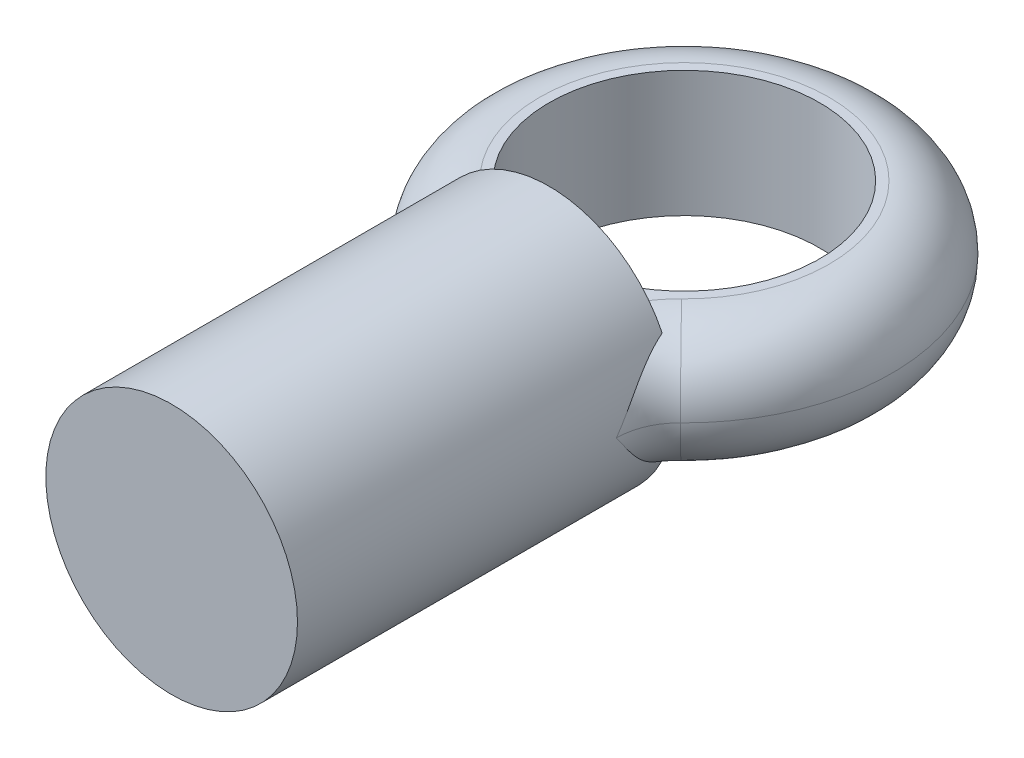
ISO-10303-21;
HEADER;
FILE_DESCRIPTION(('STEP AP214'),'2;1');
FILE_NAME('part.step','',(''),(''),'','','');
FILE_SCHEMA(('AUTOMOTIVE_DESIGN { 1 0 10303 214 1 1 1 1 }'));
ENDSEC;
DATA;
#1=APPLICATION_CONTEXT('core data for automotive mechanical design processes');
#2=APPLICATION_PROTOCOL_DEFINITION('international standard','automotive_design',2000,#1);
#3=PRODUCT_CONTEXT('',#1,'mechanical');
#4=PRODUCT('Part','Part','',(#3));
#5=PRODUCT_RELATED_PRODUCT_CATEGORY('part','',(#4));
#6=PRODUCT_DEFINITION_FORMATION('','',#4);
#7=PRODUCT_DEFINITION_CONTEXT('part definition',#1,'design');
#8=PRODUCT_DEFINITION('design','',#6,#7);
#9=PRODUCT_DEFINITION_SHAPE('','',#8);
#10=(LENGTH_UNIT() NAMED_UNIT(*) SI_UNIT(.MILLI.,.METRE.));
#11=(NAMED_UNIT(*) PLANE_ANGLE_UNIT() SI_UNIT($,.RADIAN.));
#12=(NAMED_UNIT(*) SI_UNIT($,.STERADIAN.) SOLID_ANGLE_UNIT());
#13=UNCERTAINTY_MEASURE_WITH_UNIT(LENGTH_MEASURE(1.E-05),#10,'distance_accuracy_value','');
#14=(GEOMETRIC_REPRESENTATION_CONTEXT(3) GLOBAL_UNCERTAINTY_ASSIGNED_CONTEXT((#13)) GLOBAL_UNIT_ASSIGNED_CONTEXT((#10,
#11,#12)) REPRESENTATION_CONTEXT('',''));
#15=CARTESIAN_POINT('',(0.,0.,0.));
#16=DIRECTION('',(0.,0.,1.));
#17=DIRECTION('',(1.,0.,0.));
#18=AXIS2_PLACEMENT_3D('',#15,#16,#17);
#19=CARTESIAN_POINT('',(0.,0.,30.));
#20=DIRECTION('',(0.,0.,-1.));
#21=DIRECTION('',(-1.,0.,0.));
#22=AXIS2_PLACEMENT_3D('',#19,#20,#21);
#23=CYLINDRICAL_SURFACE('',#22,10.);
#24=CARTESIAN_POINT('',(0.,0.,30.));
#25=DIRECTION('',(0.,0.,1.));
#26=DIRECTION('',(1.,0.,0.));
#27=AXIS2_PLACEMENT_3D('',#24,#25,#26);
#28=CIRCLE('',#27,10.);
#29=CARTESIAN_POINT('',(10.,0.,30.));
#30=VERTEX_POINT('',#29);
#31=EDGE_CURVE('E132',#30,#30,#28,.T.);
#32=ORIENTED_EDGE('',*,*,#31,.F.);
#33=EDGE_LOOP('',(#32));
#34=FACE_BOUND('',#33,.T.);
#35=CARTESIAN_POINT('',(-8.98554489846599,4.38861970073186,0.));
#36=CARTESIAN_POINT('',(-9.00545849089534,4.3478451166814,0.0963270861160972));
#37=CARTESIAN_POINT('',(-9.02599673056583,4.30509203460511,0.191670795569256));
#38=CARTESIAN_POINT('',(-9.06808681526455,4.21571430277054,0.38028497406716));
#39=CARTESIAN_POINT('',(-9.0896385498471,4.16909007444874,0.473555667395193));
#40=CARTESIAN_POINT('',(-9.15541795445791,4.0236338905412,0.749922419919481));
#41=CARTESIAN_POINT('',(-9.20081563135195,3.91912642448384,0.929790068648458));
#42=CARTESIAN_POINT('',(-9.29233488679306,3.69686890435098,1.27888184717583));
#43=CARTESIAN_POINT('',(-9.3384483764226,3.57922516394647,1.4481762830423));
#44=CARTESIAN_POINT('',(-9.42974629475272,3.33126460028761,1.7774941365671));
#45=CARTESIAN_POINT('',(-9.4749306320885,3.20094653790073,1.9375166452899));
#46=CARTESIAN_POINT('',(-9.55293566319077,2.95870133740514,2.21467672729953));
#47=CARTESIAN_POINT('',(-9.58630725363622,2.84894267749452,2.33356916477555));
#48=CARTESIAN_POINT('',(-9.65048757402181,2.62332602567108,2.56614670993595));
#49=CARTESIAN_POINT('',(-9.68129623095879,2.50746786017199,2.67983166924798));
#50=CARTESIAN_POINT('',(-9.73961800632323,2.27040721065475,2.90248156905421));
#51=CARTESIAN_POINT('',(-9.76712946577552,2.14920207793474,3.01144411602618));
#52=CARTESIAN_POINT('',(-9.8181959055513,1.90234455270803,3.22515559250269));
#53=CARTESIAN_POINT('',(-9.84175103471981,1.77669232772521,3.32990468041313));
#54=CARTESIAN_POINT('',(-9.88491077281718,1.51858072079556,3.53846634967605));
#55=CARTESIAN_POINT('',(-9.90440087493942,1.38602959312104,3.64218881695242));
#56=CARTESIAN_POINT('',(-9.93820973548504,1.11812778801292,3.84671303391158));
#57=CARTESIAN_POINT('',(-9.95253030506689,0.98277810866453,3.94751579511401));
#58=CARTESIAN_POINT('',(-9.97575331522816,0.709413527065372,4.14769259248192));
#59=CARTESIAN_POINT('',(-9.98462528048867,0.57138800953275,4.24705561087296));
#60=CARTESIAN_POINT('',(-9.99662819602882,0.294354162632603,4.44474645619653));
#61=CARTESIAN_POINT('',(-9.9997594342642,0.155345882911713,4.54307433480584));
#62=CARTESIAN_POINT('',(-9.99999556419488,0.0108866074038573,4.64522380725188));
#63=CARTESIAN_POINT('',(-10.0000000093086,0.0054432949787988,4.64907281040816));
#64=CARTESIAN_POINT('',(-10.,0.,4.65292180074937));
#65=B_SPLINE_CURVE_WITH_KNOTS('',3,(#35,#36,#37,#38,#39,#40,#41,#42,#43,#44,#45,#46,#47,#48,#49,
#50,#51,#52,#53,#54,#55,#56,#57,#58,#59,#60,#61,#62,#63,#64),.UNSPECIFIED.,.F.,.F.,(4,2,2,2,2,2,
2,2,2,2,2,2,2,2,4),(0.,0.319387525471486,0.638740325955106,1.27672811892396,1.90988296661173,
2.54309977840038,3.03853167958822,3.53397768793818,4.02967194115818,4.52534754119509,
5.03351370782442,5.54150166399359,6.0523056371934,6.56308398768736,6.58308399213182),.UNSPECIFIED.);
#66=CARTESIAN_POINT('',(-8.98554489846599,4.38861970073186,0.));
#67=VERTEX_POINT('',#66);
#68=CARTESIAN_POINT('',(-10.,0.,4.65292180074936));
#69=VERTEX_POINT('',#68);
#70=EDGE_CURVE('E128',#67,#69,#65,.T.);
#71=ORIENTED_EDGE('',*,*,#70,.T.);
#72=CARTESIAN_POINT('',(-8.98554489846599,-4.38861970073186,0.));
#73=CARTESIAN_POINT('',(-9.00545849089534,-4.3478451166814,0.0963270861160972));
#74=CARTESIAN_POINT('',(-9.02599673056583,-4.30509203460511,0.191670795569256));
#75=CARTESIAN_POINT('',(-9.06808681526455,-4.21571430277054,0.38028497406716));
#76=CARTESIAN_POINT('',(-9.0896385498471,-4.16909007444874,0.473555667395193));
#77=CARTESIAN_POINT('',(-9.15541795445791,-4.0236338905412,0.749922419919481));
#78=CARTESIAN_POINT('',(-9.20081563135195,-3.91912642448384,0.929790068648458));
#79=CARTESIAN_POINT('',(-9.29233488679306,-3.69686890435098,1.27888184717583));
#80=CARTESIAN_POINT('',(-9.3384483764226,-3.57922516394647,1.4481762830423));
#81=CARTESIAN_POINT('',(-9.42974629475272,-3.33126460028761,1.7774941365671));
#82=CARTESIAN_POINT('',(-9.4749306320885,-3.20094653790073,1.9375166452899));
#83=CARTESIAN_POINT('',(-9.55293566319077,-2.95870133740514,2.21467672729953));
#84=CARTESIAN_POINT('',(-9.58630725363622,-2.84894267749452,2.33356916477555));
#85=CARTESIAN_POINT('',(-9.65048757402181,-2.62332602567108,2.56614670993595));
#86=CARTESIAN_POINT('',(-9.68129623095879,-2.50746786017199,2.67983166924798));
#87=CARTESIAN_POINT('',(-9.73961800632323,-2.27040721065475,2.90248156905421));
#88=CARTESIAN_POINT('',(-9.76712946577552,-2.14920207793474,3.01144411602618));
#89=CARTESIAN_POINT('',(-9.8181959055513,-1.90234455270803,3.22515559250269));
#90=CARTESIAN_POINT('',(-9.84175103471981,-1.77669232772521,3.32990468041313));
#91=CARTESIAN_POINT('',(-9.88491077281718,-1.51858072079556,3.53846634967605));
#92=CARTESIAN_POINT('',(-9.90440087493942,-1.38602959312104,3.64218881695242));
#93=CARTESIAN_POINT('',(-9.93820973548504,-1.11812778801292,3.84671303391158));
#94=CARTESIAN_POINT('',(-9.95253030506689,-0.98277810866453,3.94751579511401));
#95=CARTESIAN_POINT('',(-9.97575331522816,-0.709413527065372,4.14769259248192));
#96=CARTESIAN_POINT('',(-9.98462528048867,-0.57138800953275,4.24705561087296));
#97=CARTESIAN_POINT('',(-9.99662819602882,-0.294354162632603,4.44474645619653));
#98=CARTESIAN_POINT('',(-9.9997594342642,-0.155345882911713,4.54307433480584));
#99=CARTESIAN_POINT('',(-9.99999556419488,-0.0108866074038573,4.64522380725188));
#100=CARTESIAN_POINT('',(-10.0000000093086,-0.0054432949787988,4.64907281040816));
#101=CARTESIAN_POINT('',(-10.,0.,4.65292180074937));
#102=B_SPLINE_CURVE_WITH_KNOTS('',3,(#72,#73,#74,#75,#76,#77,#78,#79,#80,#81,#82,#83,#84,#85,
#86,#87,#88,#89,#90,#91,#92,#93,#94,#95,#96,#97,#98,#99,#100,#101),.UNSPECIFIED.,.F.,.F.,(4,2,2,
2,2,2,2,2,2,2,2,2,2,2,4),(0.,0.319387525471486,0.638740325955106,1.27672811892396,
1.90988296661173,2.54309977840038,3.03853167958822,3.53397768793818,4.02967194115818,
4.52534754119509,5.03351370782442,5.54150166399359,6.0523056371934,6.56308398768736,
6.58308399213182),.UNSPECIFIED.);
#103=CARTESIAN_POINT('',(-8.98554489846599,-4.38861970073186,0.));
#104=VERTEX_POINT('',#103);
#105=EDGE_CURVE('E52',#69,#104,#102,.F.);
#106=ORIENTED_EDGE('',*,*,#105,.T.);
#107=CARTESIAN_POINT('',(0.,0.,0.));
#108=DIRECTION('',(0.,0.,1.));
#109=DIRECTION('',(1.,0.,0.));
#110=AXIS2_PLACEMENT_3D('',#107,#108,#109);
#111=CIRCLE('',#110,10.);
#112=CARTESIAN_POINT('',(8.98554489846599,-4.38861970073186,0.));
#113=VERTEX_POINT('',#112);
#114=EDGE_CURVE('E60',#104,#113,#111,.T.);
#115=ORIENTED_EDGE('',*,*,#114,.T.);
#116=CARTESIAN_POINT('',(8.98554489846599,-4.38861970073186,0.));
#117=CARTESIAN_POINT('',(9.00545849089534,-4.3478451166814,0.0963270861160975));
#118=CARTESIAN_POINT('',(9.02599673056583,-4.30509203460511,0.191670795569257));
#119=CARTESIAN_POINT('',(9.06808681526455,-4.21571430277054,0.38028497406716));
#120=CARTESIAN_POINT('',(9.0896385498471,-4.16909007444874,0.473555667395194));
#121=CARTESIAN_POINT('',(9.15541795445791,-4.0236338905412,0.749922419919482));
#122=CARTESIAN_POINT('',(9.20081563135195,-3.91912642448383,0.929790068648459));
#123=CARTESIAN_POINT('',(9.29233488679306,-3.69686890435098,1.27888184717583));
#124=CARTESIAN_POINT('',(9.3384483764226,-3.57922516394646,1.4481762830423));
#125=CARTESIAN_POINT('',(9.42974629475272,-3.33126460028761,1.7774941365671));
#126=CARTESIAN_POINT('',(9.4749306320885,-3.20094653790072,1.9375166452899));
#127=CARTESIAN_POINT('',(9.55293566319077,-2.95870133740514,2.21467672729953));
#128=CARTESIAN_POINT('',(9.58630725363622,-2.84894267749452,2.33356916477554));
#129=CARTESIAN_POINT('',(9.65048757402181,-2.62332602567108,2.56614670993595));
#130=CARTESIAN_POINT('',(9.68129623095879,-2.50746786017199,2.67983166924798));
#131=CARTESIAN_POINT('',(9.73961800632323,-2.27040721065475,2.90248156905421));
#132=CARTESIAN_POINT('',(9.76712946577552,-2.14920207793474,3.01144411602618));
#133=CARTESIAN_POINT('',(9.8181959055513,-1.90234455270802,3.22515559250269));
#134=CARTESIAN_POINT('',(9.84175103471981,-1.77669232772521,3.32990468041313));
#135=CARTESIAN_POINT('',(9.88491077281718,-1.51858072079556,3.53846634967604));
#136=CARTESIAN_POINT('',(9.90440087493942,-1.38602959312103,3.64218881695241));
#137=CARTESIAN_POINT('',(9.93820973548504,-1.11812778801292,3.84671303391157));
#138=CARTESIAN_POINT('',(9.95253030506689,-0.982778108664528,3.94751579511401));
#139=CARTESIAN_POINT('',(9.97575331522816,-0.709413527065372,4.14769259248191));
#140=CARTESIAN_POINT('',(9.98462528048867,-0.57138800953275,4.24705561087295));
#141=CARTESIAN_POINT('',(9.99662819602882,-0.294354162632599,4.44474645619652));
#142=CARTESIAN_POINT('',(9.9997594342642,-0.155345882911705,4.54307433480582));
#143=CARTESIAN_POINT('',(9.99999556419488,-0.0108866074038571,4.64522380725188));
#144=CARTESIAN_POINT('',(10.0000000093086,-0.00544329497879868,4.64907281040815));
#145=CARTESIAN_POINT('',(10.,0.,4.65292180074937));
#146=B_SPLINE_CURVE_WITH_KNOTS('',3,(#116,#117,#118,#119,#120,#121,#122,#123,#124,#125,#126,
#127,#128,#129,#130,#131,#132,#133,#134,#135,#136,#137,#138,#139,#140,#141,#142,#143,#144,#145),
.UNSPECIFIED.,.F.,.F.,(4,2,2,2,2,2,2,2,2,2,2,2,2,2,4),(0.,0.319387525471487,0.638740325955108,
1.27672811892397,1.90988296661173,2.54309977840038,3.03853167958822,3.53397768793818,
4.02967194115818,4.52534754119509,5.03351370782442,5.54150166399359,6.05230563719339,
6.56308398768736,6.58308399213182),.UNSPECIFIED.);
#147=CARTESIAN_POINT('',(10.,0.,4.65292180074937));
#148=VERTEX_POINT('',#147);
#149=EDGE_CURVE('E146',#113,#148,#146,.T.);
#150=ORIENTED_EDGE('',*,*,#149,.T.);
#151=CARTESIAN_POINT('',(8.98554489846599,4.38861970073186,0.));
#152=CARTESIAN_POINT('',(9.00545849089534,4.3478451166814,0.0963270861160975));
#153=CARTESIAN_POINT('',(9.02599673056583,4.30509203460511,0.191670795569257));
#154=CARTESIAN_POINT('',(9.06808681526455,4.21571430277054,0.38028497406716));
#155=CARTESIAN_POINT('',(9.0896385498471,4.16909007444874,0.473555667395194));
#156=CARTESIAN_POINT('',(9.15541795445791,4.0236338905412,0.749922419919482));
#157=CARTESIAN_POINT('',(9.20081563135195,3.91912642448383,0.929790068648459));
#158=CARTESIAN_POINT('',(9.29233488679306,3.69686890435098,1.27888184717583));
#159=CARTESIAN_POINT('',(9.3384483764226,3.57922516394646,1.4481762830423));
#160=CARTESIAN_POINT('',(9.42974629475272,3.33126460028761,1.7774941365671));
#161=CARTESIAN_POINT('',(9.4749306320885,3.20094653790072,1.9375166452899));
#162=CARTESIAN_POINT('',(9.55293566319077,2.95870133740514,2.21467672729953));
#163=CARTESIAN_POINT('',(9.58630725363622,2.84894267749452,2.33356916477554));
#164=CARTESIAN_POINT('',(9.65048757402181,2.62332602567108,2.56614670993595));
#165=CARTESIAN_POINT('',(9.68129623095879,2.50746786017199,2.67983166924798));
#166=CARTESIAN_POINT('',(9.73961800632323,2.27040721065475,2.90248156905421));
#167=CARTESIAN_POINT('',(9.76712946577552,2.14920207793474,3.01144411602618));
#168=CARTESIAN_POINT('',(9.8181959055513,1.90234455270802,3.22515559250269));
#169=CARTESIAN_POINT('',(9.84175103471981,1.77669232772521,3.32990468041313));
#170=CARTESIAN_POINT('',(9.88491077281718,1.51858072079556,3.53846634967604));
#171=CARTESIAN_POINT('',(9.90440087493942,1.38602959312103,3.64218881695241));
#172=CARTESIAN_POINT('',(9.93820973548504,1.11812778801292,3.84671303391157));
#173=CARTESIAN_POINT('',(9.95253030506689,0.982778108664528,3.94751579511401));
#174=CARTESIAN_POINT('',(9.97575331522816,0.709413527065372,4.14769259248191));
#175=CARTESIAN_POINT('',(9.98462528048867,0.57138800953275,4.24705561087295));
#176=CARTESIAN_POINT('',(9.99662819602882,0.294354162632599,4.44474645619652));
#177=CARTESIAN_POINT('',(9.9997594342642,0.155345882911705,4.54307433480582));
#178=CARTESIAN_POINT('',(9.99999556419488,0.0108866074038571,4.64522380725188));
#179=CARTESIAN_POINT('',(10.0000000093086,0.00544329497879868,4.64907281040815));
#180=CARTESIAN_POINT('',(10.,0.,4.65292180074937));
#181=B_SPLINE_CURVE_WITH_KNOTS('',3,(#151,#152,#153,#154,#155,#156,#157,#158,#159,#160,#161,
#162,#163,#164,#165,#166,#167,#168,#169,#170,#171,#172,#173,#174,#175,#176,#177,#178,#179,#180),
.UNSPECIFIED.,.F.,.F.,(4,2,2,2,2,2,2,2,2,2,2,2,2,2,4),(0.,0.319387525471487,0.638740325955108,
1.27672811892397,1.90988296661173,2.54309977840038,3.03853167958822,3.53397768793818,
4.02967194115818,4.52534754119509,5.03351370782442,5.54150166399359,6.05230563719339,
6.56308398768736,6.58308399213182),.UNSPECIFIED.);
#182=CARTESIAN_POINT('',(8.98554489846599,4.38861970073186,0.));
#183=VERTEX_POINT('',#182);
#184=EDGE_CURVE('E130',#148,#183,#181,.F.);
#185=ORIENTED_EDGE('',*,*,#184,.T.);
#186=EDGE_CURVE('E125',#183,#67,#111,.T.);
#187=ORIENTED_EDGE('',*,*,#186,.T.);
#188=EDGE_LOOP('',(#71,#106,#115,#150,#185,#187));
#189=FACE_BOUND('',#188,.T.);
#190=ADVANCED_FACE('F41',(#34,#189),#23,.T.);
#191=CARTESIAN_POINT('',(0.,0.,0.));
#192=DIRECTION('',(0.,0.,1.));
#193=DIRECTION('',(1.,0.,0.));
#194=AXIS2_PLACEMENT_3D('',#191,#192,#193);
#195=PLANE('',#194);
#196=DIRECTION('',(-1.,0.,0.));
#197=VECTOR('',#196,1.);
#198=CARTESIAN_POINT('',(0.,-5.,0.));
#199=LINE('',#198,#197);
#200=CARTESIAN_POINT('',(6.14842846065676,-5.,0.));
#201=VERTEX_POINT('',#200);
#202=CARTESIAN_POINT('',(0.,-5.,0.));
#203=VERTEX_POINT('',#202);
#204=EDGE_CURVE('E308',#201,#203,#199,.T.);
#205=ORIENTED_EDGE('',*,*,#204,.F.);
#206=CARTESIAN_POINT('',(6.14842846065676,-5.,0.));
#207=CARTESIAN_POINT('',(6.36361530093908,-5.00003436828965,0.));
#208=CARTESIAN_POINT('',(6.57868921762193,-4.98912094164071,0.));
#209=CARTESIAN_POINT('',(7.0066891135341,-4.94671326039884,0.));
#210=CARTESIAN_POINT('',(7.21961627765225,-4.91523107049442,0.));
#211=CARTESIAN_POINT('',(7.63817105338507,-4.83367683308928,0.));
#212=CARTESIAN_POINT('',(7.8438611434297,-4.78392047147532,0.));
#213=CARTESIAN_POINT('',(8.2502016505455,-4.667159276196,0.));
#214=CARTESIAN_POINT('',(8.4508541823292,-4.60016181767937,0.));
#215=CARTESIAN_POINT('',(8.70505828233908,-4.50379940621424,0.));
#216=CARTESIAN_POINT('',(8.76143521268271,-4.48168360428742,0.));
#217=CARTESIAN_POINT('',(8.87381141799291,-4.43612806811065,0.));
#218=CARTESIAN_POINT('',(8.92980944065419,-4.41268524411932,0.));
#219=CARTESIAN_POINT('',(8.98554489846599,-4.38861970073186,0.));
#220=B_SPLINE_CURVE_WITH_KNOTS('',3,(#206,#207,#208,#209,#210,#211,#212,#213,#214,#215,#216,
#217,#218,#219),.UNSPECIFIED.,.F.,.F.,(4,2,2,2,2,2,4),(0.,0.645121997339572,1.28986593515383,
1.92395904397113,2.55778135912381,2.73945098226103,2.92156253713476),.UNSPECIFIED.);
#221=EDGE_CURVE('E144',#201,#113,#220,.T.);
#222=ORIENTED_EDGE('',*,*,#221,.T.);
#223=ORIENTED_EDGE('',*,*,#114,.F.);
#224=CARTESIAN_POINT('',(-8.98554489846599,-4.38861970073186,0.));
#225=CARTESIAN_POINT('',(-8.78896240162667,-4.47352549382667,0.));
#226=CARTESIAN_POINT('',(-8.58893449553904,-4.55070423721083,0.));
#227=CARTESIAN_POINT('',(-8.18276234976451,-4.68828880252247,0.));
#228=CARTESIAN_POINT('',(-7.97660675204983,-4.74866100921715,0.));
#229=CARTESIAN_POINT('',(-7.56370953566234,-4.84999156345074,0.));
#230=CARTESIAN_POINT('',(-7.35705369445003,-4.89129742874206,0.));
#231=CARTESIAN_POINT('',(-6.94101576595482,-4.95480950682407,0.));
#232=CARTESIAN_POINT('',(-6.73163747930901,-4.97703993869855,0.));
#233=CARTESIAN_POINT('',(-6.45968820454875,-4.99275873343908,0.));
#234=CARTESIAN_POINT('',(-6.39757453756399,-4.99546308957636,0.));
#235=CARTESIAN_POINT('',(-6.27311955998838,-4.99908595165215,0.));
#236=CARTESIAN_POINT('',(-6.21077810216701,-4.99999938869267,0.));
#237=CARTESIAN_POINT('',(-6.14842846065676,-5.,0.));
#238=B_SPLINE_CURVE_WITH_KNOTS('',3,(#224,#225,#226,#227,#228,#229,#230,#231,#232,#233,#234,
#235,#236,#237),.UNSPECIFIED.,.F.,.F.,(4,2,2,2,2,2,4),(0.,0.642391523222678,1.28605882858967,
1.91747957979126,2.5480974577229,2.73459665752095,2.92162295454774),.UNSPECIFIED.);
#239=CARTESIAN_POINT('',(-6.14842846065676,-5.,0.));
#240=VERTEX_POINT('',#239);
#241=EDGE_CURVE('E12',#104,#240,#238,.T.);
#242=ORIENTED_EDGE('',*,*,#241,.T.);
#243=EDGE_CURVE('E202',#203,#240,#199,.T.);
#244=ORIENTED_EDGE('',*,*,#243,.F.);
#245=EDGE_LOOP('',(#205,#222,#223,#242,#244));
#246=FACE_BOUND('',#245,.T.);
#247=ADVANCED_FACE('F257',(#246),#195,.F.);
#248=CARTESIAN_POINT('',(0.,0.,30.));
#249=DIRECTION('',(0.,0.,1.));
#250=DIRECTION('',(1.,0.,0.));
#251=AXIS2_PLACEMENT_3D('',#248,#249,#250);
#252=PLANE('',#251);
#253=ORIENTED_EDGE('',*,*,#31,.T.);
#254=EDGE_LOOP('',(#253));
#255=FACE_BOUND('',#254,.T.);
#256=ADVANCED_FACE('F262',(#255),#252,.T.);
#257=ORIENTED_EDGE('',*,*,#186,.F.);
#258=CARTESIAN_POINT('',(8.98554489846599,4.38861970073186,0.));
#259=CARTESIAN_POINT('',(8.78896240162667,4.47352549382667,0.));
#260=CARTESIAN_POINT('',(8.58893449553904,4.55070423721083,0.));
#261=CARTESIAN_POINT('',(8.18276234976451,4.68828880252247,0.));
#262=CARTESIAN_POINT('',(7.97660675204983,4.74866100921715,0.));
#263=CARTESIAN_POINT('',(7.56370953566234,4.84999156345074,0.));
#264=CARTESIAN_POINT('',(7.35705369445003,4.89129742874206,0.));
#265=CARTESIAN_POINT('',(6.94101576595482,4.95480950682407,0.));
#266=CARTESIAN_POINT('',(6.73163747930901,4.97703993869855,0.));
#267=CARTESIAN_POINT('',(6.45968820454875,4.99275873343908,0.));
#268=CARTESIAN_POINT('',(6.39757453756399,4.99546308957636,0.));
#269=CARTESIAN_POINT('',(6.27311955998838,4.99908595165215,0.));
#270=CARTESIAN_POINT('',(6.210778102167,4.99999938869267,0.));
#271=CARTESIAN_POINT('',(6.14842846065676,5.,0.));
#272=B_SPLINE_CURVE_WITH_KNOTS('',3,(#258,#259,#260,#261,#262,#263,#264,#265,#266,#267,#268,
#269,#270,#271),.UNSPECIFIED.,.F.,.F.,(4,2,2,2,2,2,4),(0.,0.642391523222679,1.28605882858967,
1.91747957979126,2.5480974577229,2.73459665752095,2.92162295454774),.UNSPECIFIED.);
#273=CARTESIAN_POINT('',(6.14842846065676,5.,0.));
#274=VERTEX_POINT('',#273);
#275=EDGE_CURVE('E140',#183,#274,#272,.T.);
#276=ORIENTED_EDGE('',*,*,#275,.T.);
#277=DIRECTION('',(-1.,0.,0.));
#278=VECTOR('',#277,1.);
#279=CARTESIAN_POINT('',(0.,5.,0.));
#280=LINE('',#279,#278);
#281=CARTESIAN_POINT('',(0.,5.,0.));
#282=VERTEX_POINT('',#281);
#283=EDGE_CURVE('E87',#274,#282,#280,.T.);
#284=ORIENTED_EDGE('',*,*,#283,.T.);
#285=CARTESIAN_POINT('',(-6.14842846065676,5.,0.));
#286=VERTEX_POINT('',#285);
#287=EDGE_CURVE('E137',#282,#286,#280,.T.);
#288=ORIENTED_EDGE('',*,*,#287,.T.);
#289=CARTESIAN_POINT('',(-6.14842846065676,5.,0.));
#290=CARTESIAN_POINT('',(-6.36361530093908,5.00003436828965,0.));
#291=CARTESIAN_POINT('',(-6.57868921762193,4.98912094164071,0.));
#292=CARTESIAN_POINT('',(-7.0066891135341,4.94671326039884,0.));
#293=CARTESIAN_POINT('',(-7.21961627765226,4.91523107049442,0.));
#294=CARTESIAN_POINT('',(-7.63817105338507,4.83367683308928,0.));
#295=CARTESIAN_POINT('',(-7.8438611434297,4.78392047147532,0.));
#296=CARTESIAN_POINT('',(-8.2502016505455,4.667159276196,0.));
#297=CARTESIAN_POINT('',(-8.4508541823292,4.60016181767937,0.));
#298=CARTESIAN_POINT('',(-8.70505828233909,4.50379940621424,0.));
#299=CARTESIAN_POINT('',(-8.76143521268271,4.48168360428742,0.));
#300=CARTESIAN_POINT('',(-8.87381141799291,4.43612806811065,0.));
#301=CARTESIAN_POINT('',(-8.92980944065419,4.41268524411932,0.));
#302=CARTESIAN_POINT('',(-8.98554489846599,4.38861970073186,0.));
#303=B_SPLINE_CURVE_WITH_KNOTS('',3,(#289,#290,#291,#292,#293,#294,#295,#296,#297,#298,#299,
#300,#301,#302),.UNSPECIFIED.,.F.,.F.,(4,2,2,2,2,2,4),(0.,0.645121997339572,1.28986593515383,
1.92395904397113,2.55778135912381,2.73945098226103,2.92156253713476),.UNSPECIFIED.);
#304=EDGE_CURVE('E135',#286,#67,#303,.T.);
#305=ORIENTED_EDGE('',*,*,#304,.T.);
#306=EDGE_LOOP('',(#257,#276,#284,#288,#305));
#307=FACE_BOUND('',#306,.T.);
#308=ADVANCED_FACE('F136',(#307),#195,.F.);
#309=CARTESIAN_POINT('',(0.,-5.,-10.75));
#310=DIRECTION('',(0.,1.,0.));
#311=DIRECTION('',(0.,0.,1.));
#312=AXIS2_PLACEMENT_3D('',#309,#310,#311);
#313=PLANE('',#312);
#314=CARTESIAN_POINT('',(0.,-5.,-10.75));
#315=DIRECTION('',(0.,1.,0.));
#316=DIRECTION('',(0.,0.,1.));
#317=AXIS2_PLACEMENT_3D('',#314,#315,#316);
#318=CIRCLE('',#317,11.5);
#319=CARTESIAN_POINT('',(-8.02325581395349,-5.,-2.51122787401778));
#320=VERTEX_POINT('',#319);
#321=CARTESIAN_POINT('',(8.02325581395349,-5.,-2.51122787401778));
#322=VERTEX_POINT('',#321);
#323=EDGE_CURVE('E236',#320,#322,#318,.F.);
#324=ORIENTED_EDGE('',*,*,#323,.T.);
#325=CARTESIAN_POINT('',(15.,-5.,4.65292180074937));
#326=DIRECTION('',(0.,1.,0.));
#327=DIRECTION('',(0.,0.,1.));
#328=AXIS2_PLACEMENT_3D('',#325,#326,#327);
#329=CIRCLE('',#328,10.);
#330=EDGE_CURVE('E235',#322,#201,#329,.T.);
#331=ORIENTED_EDGE('',*,*,#330,.T.);
#332=ORIENTED_EDGE('',*,*,#204,.T.);
#333=CARTESIAN_POINT('',(0.,-5.,-10.75));
#334=DIRECTION('',(0.,1.,0.));
#335=DIRECTION('',(0.,0.,1.));
#336=AXIS2_PLACEMENT_3D('',#333,#334,#335);
#337=CIRCLE('',#336,10.75);
#338=EDGE_CURVE('E209',#203,#203,#337,.T.);
#339=ORIENTED_EDGE('',*,*,#338,.T.);
#340=ORIENTED_EDGE('',*,*,#243,.T.);
#341=CARTESIAN_POINT('',(-15.,-5.,4.65292180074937));
#342=DIRECTION('',(0.,1.,0.));
#343=DIRECTION('',(0.,0.,1.));
#344=AXIS2_PLACEMENT_3D('',#341,#342,#343);
#345=CIRCLE('',#344,10.);
#346=EDGE_CURVE('E231',#240,#320,#345,.T.);
#347=ORIENTED_EDGE('',*,*,#346,.T.);
#348=EDGE_LOOP('',(#324,#331,#332,#339,#340,#347));
#349=FACE_BOUND('',#348,.T.);
#350=ADVANCED_FACE('F271',(#349),#313,.F.);
#351=CARTESIAN_POINT('',(0.,5.,-10.75));
#352=DIRECTION('',(0.,1.,0.));
#353=DIRECTION('',(0.,0.,1.));
#354=AXIS2_PLACEMENT_3D('',#351,#352,#353);
#355=PLANE('',#354);
#356=ORIENTED_EDGE('',*,*,#283,.F.);
#357=CARTESIAN_POINT('',(15.,5.,4.65292180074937));
#358=DIRECTION('',(0.,1.,0.));
#359=DIRECTION('',(0.,0.,1.));
#360=AXIS2_PLACEMENT_3D('',#357,#358,#359);
#361=CIRCLE('',#360,10.);
#362=CARTESIAN_POINT('',(8.02325581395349,5.,-2.51122787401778));
#363=VERTEX_POINT('',#362);
#364=EDGE_CURVE('E309',#274,#363,#361,.F.);
#365=ORIENTED_EDGE('',*,*,#364,.T.);
#366=CARTESIAN_POINT('',(0.,5.,-10.75));
#367=DIRECTION('',(0.,1.,0.));
#368=DIRECTION('',(0.,0.,1.));
#369=AXIS2_PLACEMENT_3D('',#366,#367,#368);
#370=CIRCLE('',#369,11.5);
#371=CARTESIAN_POINT('',(-8.02325581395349,5.,-2.51122787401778));
#372=VERTEX_POINT('',#371);
#373=EDGE_CURVE('E304',#363,#372,#370,.T.);
#374=ORIENTED_EDGE('',*,*,#373,.T.);
#375=CARTESIAN_POINT('',(-15.,5.,4.65292180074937));
#376=DIRECTION('',(0.,1.,0.));
#377=DIRECTION('',(0.,0.,1.));
#378=AXIS2_PLACEMENT_3D('',#375,#376,#377);
#379=CIRCLE('',#378,10.);
#380=EDGE_CURVE('E307',#372,#286,#379,.F.);
#381=ORIENTED_EDGE('',*,*,#380,.T.);
#382=ORIENTED_EDGE('',*,*,#287,.F.);
#383=CARTESIAN_POINT('',(0.,5.,-10.75));
#384=DIRECTION('',(0.,1.,0.));
#385=DIRECTION('',(0.,0.,1.));
#386=AXIS2_PLACEMENT_3D('',#383,#384,#385);
#387=CIRCLE('',#386,10.75);
#388=EDGE_CURVE('E212',#282,#282,#387,.T.);
#389=ORIENTED_EDGE('',*,*,#388,.F.);
#390=EDGE_LOOP('',(#356,#365,#374,#381,#382,#389));
#391=FACE_BOUND('',#390,.T.);
#392=ADVANCED_FACE('F310',(#391),#355,.T.);
#393=CARTESIAN_POINT('',(0.,-5.,-10.75));
#394=DIRECTION('',(0.,1.,0.));
#395=DIRECTION('',(0.,0.,1.));
#396=AXIS2_PLACEMENT_3D('',#393,#394,#395);
#397=CYLINDRICAL_SURFACE('',#396,10.75);
#398=ORIENTED_EDGE('',*,*,#388,.T.);
#399=EDGE_LOOP('',(#398));
#400=FACE_BOUND('',#399,.T.);
#401=ORIENTED_EDGE('',*,*,#338,.F.);
#402=EDGE_LOOP('',(#401));
#403=FACE_BOUND('',#402,.T.);
#404=ADVANCED_FACE('F322',(#400,#403),#397,.F.);
#405=CARTESIAN_POINT('',(-15.,0.,4.65292180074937));
#406=DIRECTION('',(0.,1.,0.));
#407=DIRECTION('',(0.,0.,1.));
#408=AXIS2_PLACEMENT_3D('',#405,#406,#407);
#409=TOROIDAL_SURFACE('',#408,10.,5.);
#410=ORIENTED_EDGE('',*,*,#241,.F.);
#411=ORIENTED_EDGE('',*,*,#105,.F.);
#412=CARTESIAN_POINT('',(-15.,-5.75167462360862E-12,4.65292180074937));
#413=DIRECTION('',(0.,1.,0.));
#414=DIRECTION('',(0.,0.,1.));
#415=AXIS2_PLACEMENT_3D('',#412,#413,#414);
#416=CIRCLE('',#415,5.);
#417=CARTESIAN_POINT('',(-11.5116279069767,0.,1.07084696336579));
#418=VERTEX_POINT('',#417);
#419=EDGE_CURVE('E46',#418,#69,#416,.F.);
#420=ORIENTED_EDGE('',*,*,#419,.F.);
#421=CARTESIAN_POINT('',(-8.02325581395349,0.,-2.51122787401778));
#422=DIRECTION('',(-0.716414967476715,0.,-0.697674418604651));
#423=DIRECTION('',(-0.697674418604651,0.,0.716414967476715));
#424=AXIS2_PLACEMENT_3D('',#421,#422,#423);
#425=CIRCLE('',#424,5.);
#426=EDGE_CURVE('E217',#320,#418,#425,.T.);
#427=ORIENTED_EDGE('',*,*,#426,.F.);
#428=ORIENTED_EDGE('',*,*,#346,.F.);
#429=EDGE_LOOP('',(#410,#411,#420,#427,#428));
#430=FACE_BOUND('',#429,.T.);
#431=ADVANCED_FACE('F43',(#430),#409,.T.);
#432=CARTESIAN_POINT('',(-15.,0.,4.65292180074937));
#433=DIRECTION('',(0.,1.,0.));
#434=DIRECTION('',(0.,0.,1.));
#435=AXIS2_PLACEMENT_3D('',#432,#433,#434);
#436=TOROIDAL_SURFACE('',#435,10.,5.);
#437=ORIENTED_EDGE('',*,*,#304,.F.);
#438=ORIENTED_EDGE('',*,*,#380,.F.);
#439=CARTESIAN_POINT('',(-8.02325581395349,5.75171675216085E-12,-2.51122787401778));
#440=DIRECTION('',(-0.716414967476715,0.,-0.697674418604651));
#441=DIRECTION('',(-0.697674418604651,0.,0.716414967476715));
#442=AXIS2_PLACEMENT_3D('',#439,#440,#441);
#443=CIRCLE('',#442,5.);
#444=EDGE_CURVE('E219',#418,#372,#443,.T.);
#445=ORIENTED_EDGE('',*,*,#444,.F.);
#446=ORIENTED_EDGE('',*,*,#419,.T.);
#447=ORIENTED_EDGE('',*,*,#70,.F.);
#448=EDGE_LOOP('',(#437,#438,#445,#446,#447));
#449=FACE_BOUND('',#448,.T.);
#450=ADVANCED_FACE('F142',(#449),#436,.T.);
#451=CARTESIAN_POINT('',(0.,0.,-10.75));
#452=DIRECTION('',(0.,1.,0.));
#453=DIRECTION('',(0.,0.,1.));
#454=AXIS2_PLACEMENT_3D('',#451,#452,#453);
#455=TOROIDAL_SURFACE('',#454,11.5,5.);
#456=CARTESIAN_POINT('',(8.02325581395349,0.,-2.51122787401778));
#457=DIRECTION('',(-0.716414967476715,0.,0.697674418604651));
#458=DIRECTION('',(0.697674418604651,0.,0.716414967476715));
#459=AXIS2_PLACEMENT_3D('',#456,#457,#458);
#460=CIRCLE('',#459,5.);
#461=CARTESIAN_POINT('',(11.5116279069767,0.,1.07084696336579));
#462=VERTEX_POINT('',#461);
#463=EDGE_CURVE('E71',#322,#462,#460,.T.);
#464=ORIENTED_EDGE('',*,*,#463,.F.);
#465=ORIENTED_EDGE('',*,*,#323,.F.);
#466=ORIENTED_EDGE('',*,*,#426,.T.);
#467=CARTESIAN_POINT('',(0.,0.,-10.75));
#468=DIRECTION('',(0.,1.,0.));
#469=DIRECTION('',(0.,0.,1.));
#470=AXIS2_PLACEMENT_3D('',#467,#468,#469);
#471=CIRCLE('',#470,16.5);
#472=EDGE_CURVE('E295',#462,#418,#471,.T.);
#473=ORIENTED_EDGE('',*,*,#472,.F.);
#474=EDGE_LOOP('',(#464,#465,#466,#473));
#475=FACE_BOUND('',#474,.T.);
#476=ADVANCED_FACE('F171',(#475),#455,.T.);
#477=CARTESIAN_POINT('',(15.,0.,4.65292180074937));
#478=DIRECTION('',(0.,1.,0.));
#479=DIRECTION('',(0.,0.,1.));
#480=AXIS2_PLACEMENT_3D('',#477,#478,#479);
#481=TOROIDAL_SURFACE('',#480,10.,5.);
#482=ORIENTED_EDGE('',*,*,#330,.F.);
#483=ORIENTED_EDGE('',*,*,#463,.T.);
#484=CARTESIAN_POINT('',(15.,0.,4.65292180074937));
#485=DIRECTION('',(0.,1.,0.));
#486=DIRECTION('',(0.,0.,1.));
#487=AXIS2_PLACEMENT_3D('',#484,#485,#486);
#488=CIRCLE('',#487,5.);
#489=EDGE_CURVE('E286',#148,#462,#488,.F.);
#490=ORIENTED_EDGE('',*,*,#489,.F.);
#491=ORIENTED_EDGE('',*,*,#149,.F.);
#492=ORIENTED_EDGE('',*,*,#221,.F.);
#493=EDGE_LOOP('',(#482,#483,#490,#491,#492));
#494=FACE_BOUND('',#493,.T.);
#495=ADVANCED_FACE('F174',(#494),#481,.T.);
#496=CARTESIAN_POINT('',(0.,0.,-10.75));
#497=DIRECTION('',(0.,1.,0.));
#498=DIRECTION('',(0.,0.,1.));
#499=AXIS2_PLACEMENT_3D('',#496,#497,#498);
#500=TOROIDAL_SURFACE('',#499,11.5,5.);
#501=ORIENTED_EDGE('',*,*,#444,.T.);
#502=ORIENTED_EDGE('',*,*,#373,.F.);
#503=CARTESIAN_POINT('',(8.02325581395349,0.,-2.51122787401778));
#504=DIRECTION('',(-0.716414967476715,0.,0.697674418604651));
#505=DIRECTION('',(0.697674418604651,0.,0.716414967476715));
#506=AXIS2_PLACEMENT_3D('',#503,#504,#505);
#507=CIRCLE('',#506,5.);
#508=EDGE_CURVE('E283',#462,#363,#507,.T.);
#509=ORIENTED_EDGE('',*,*,#508,.F.);
#510=ORIENTED_EDGE('',*,*,#472,.T.);
#511=EDGE_LOOP('',(#501,#502,#509,#510));
#512=FACE_BOUND('',#511,.T.);
#513=ADVANCED_FACE('F179',(#512),#500,.T.);
#514=CARTESIAN_POINT('',(15.,0.,4.65292180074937));
#515=DIRECTION('',(0.,1.,0.));
#516=DIRECTION('',(0.,0.,1.));
#517=AXIS2_PLACEMENT_3D('',#514,#515,#516);
#518=TOROIDAL_SURFACE('',#517,10.,5.);
#519=ORIENTED_EDGE('',*,*,#184,.F.);
#520=ORIENTED_EDGE('',*,*,#489,.T.);
#521=ORIENTED_EDGE('',*,*,#508,.T.);
#522=ORIENTED_EDGE('',*,*,#364,.F.);
#523=ORIENTED_EDGE('',*,*,#275,.F.);
#524=EDGE_LOOP('',(#519,#520,#521,#522,#523));
#525=FACE_BOUND('',#524,.T.);
#526=ADVANCED_FACE('F247',(#525),#518,.T.);
#527=CLOSED_SHELL('',(#190,#247,#256,#308,#350,#392,#404,#431,#450,#476,#495,#513,#526));
#528=MANIFOLD_SOLID_BREP('B2',#527);
#529=ADVANCED_BREP_SHAPE_REPRESENTATION('',(#18,#528),#14);
#530=SHAPE_DEFINITION_REPRESENTATION(#9,#529);
ENDSEC;
END-ISO-10303-21;
